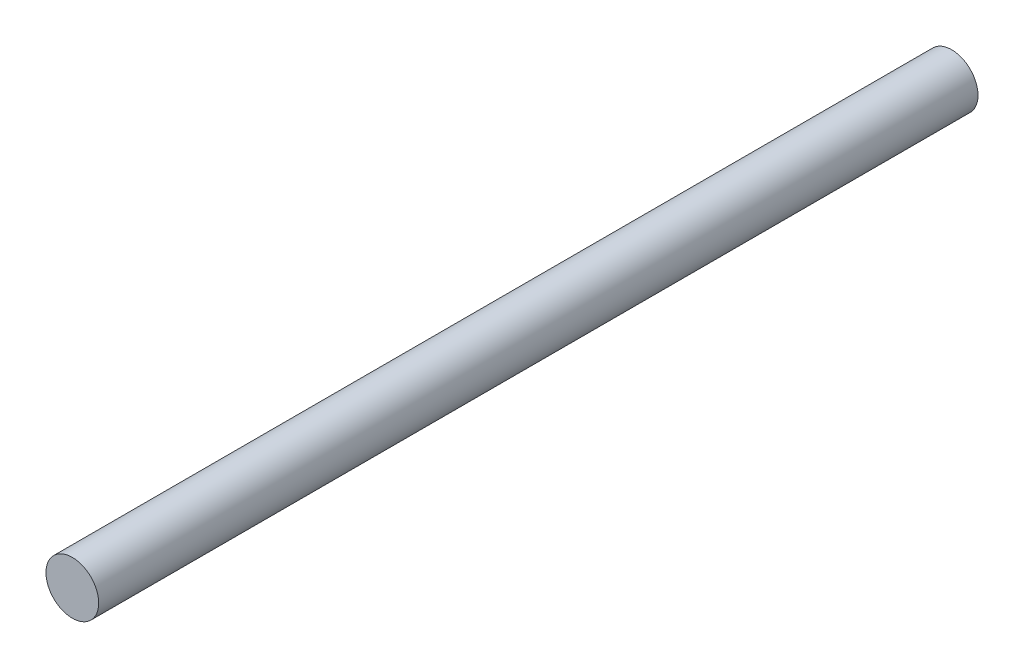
from build123d import *

# Parameters (mm, degrees)
SKETCH1_R           = 3
BOSS_EXTRUDE1_DEPTH = 100


with BuildPart() as part:
    # Sketch1 → Boss-Extrude1 (new body)
    with BuildSketch(Plane.XY):
        Circle(SKETCH1_R)
    extrude(amount=BOSS_EXTRUDE1_DEPTH)


solid = part.part
